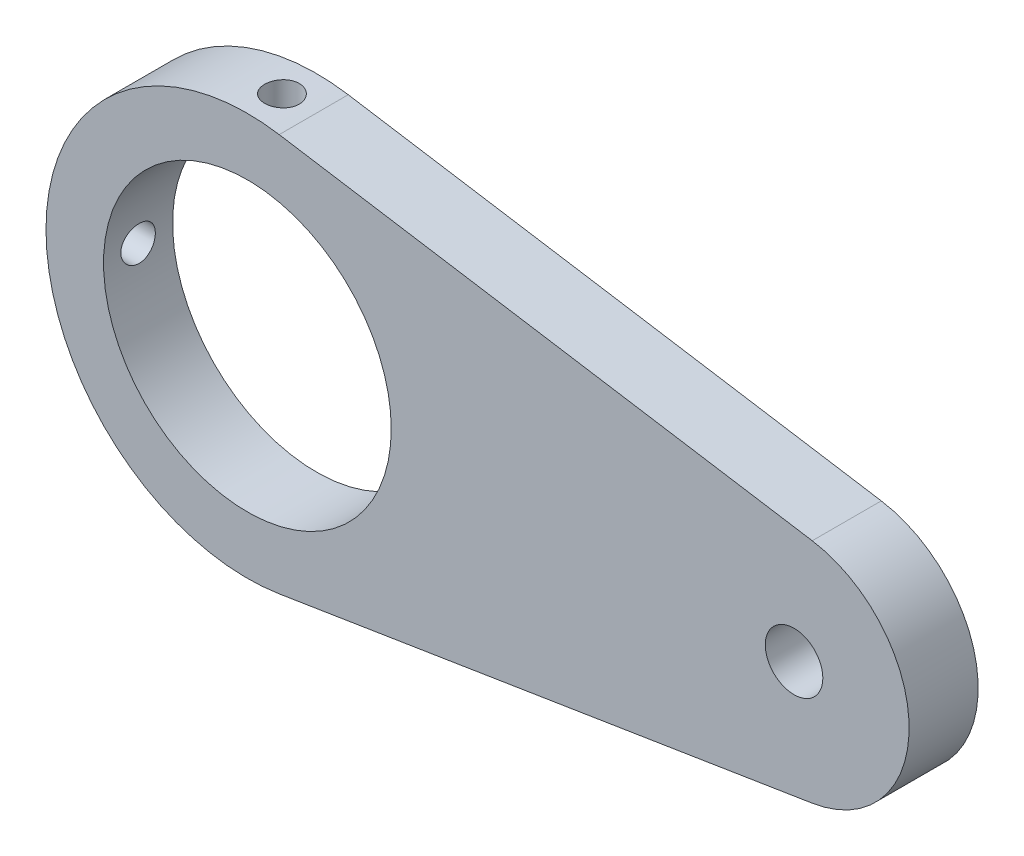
ISO-10303-21;
HEADER;
FILE_DESCRIPTION(('STEP AP214'),'2;1');
FILE_NAME('part.step','',(''),(''),'','','');
FILE_SCHEMA(('AUTOMOTIVE_DESIGN { 1 0 10303 214 1 1 1 1 }'));
ENDSEC;
DATA;
#1=APPLICATION_CONTEXT('core data for automotive mechanical design processes');
#2=APPLICATION_PROTOCOL_DEFINITION('international standard','automotive_design',2000,#1);
#3=PRODUCT_CONTEXT('',#1,'mechanical');
#4=PRODUCT('Part','Part','',(#3));
#5=PRODUCT_RELATED_PRODUCT_CATEGORY('part','',(#4));
#6=PRODUCT_DEFINITION_FORMATION('','',#4);
#7=PRODUCT_DEFINITION_CONTEXT('part definition',#1,'design');
#8=PRODUCT_DEFINITION('design','',#6,#7);
#9=PRODUCT_DEFINITION_SHAPE('','',#8);
#10=(LENGTH_UNIT() NAMED_UNIT(*) SI_UNIT(.MILLI.,.METRE.));
#11=(NAMED_UNIT(*) PLANE_ANGLE_UNIT() SI_UNIT($,.RADIAN.));
#12=(NAMED_UNIT(*) SI_UNIT($,.STERADIAN.) SOLID_ANGLE_UNIT());
#13=UNCERTAINTY_MEASURE_WITH_UNIT(LENGTH_MEASURE(1.E-05),#10,'distance_accuracy_value','');
#14=(GEOMETRIC_REPRESENTATION_CONTEXT(3) GLOBAL_UNCERTAINTY_ASSIGNED_CONTEXT((#13)) GLOBAL_UNIT_ASSIGNED_CONTEXT((#10,
#11,#12)) REPRESENTATION_CONTEXT('',''));
#15=CARTESIAN_POINT('',(0.,0.,0.));
#16=DIRECTION('',(0.,0.,1.));
#17=DIRECTION('',(1.,0.,0.));
#18=AXIS2_PLACEMENT_3D('',#15,#16,#17);
#19=CARTESIAN_POINT('',(0.,0.,12.));
#20=DIRECTION('',(0.,0.,-1.));
#21=DIRECTION('',(-1.,0.,0.));
#22=AXIS2_PLACEMENT_3D('',#19,#20,#21);
#23=CYLINDRICAL_SURFACE('',#22,35.);
#24=CARTESIAN_POINT('',(0.,35.,9.));
#25=CARTESIAN_POINT('',(-0.168180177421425,34.9999983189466,8.99999266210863));
#26=CARTESIAN_POINT('',(-0.336474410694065,34.9987748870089,8.98581013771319));
#27=CARTESIAN_POINT('',(-0.668405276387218,34.9940120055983,8.92944276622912));
#28=CARTESIAN_POINT('',(-0.832036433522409,34.9904699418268,8.8872263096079));
#29=CARTESIAN_POINT('',(-1.14978580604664,34.9814700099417,8.77602193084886));
#30=CARTESIAN_POINT('',(-1.30390939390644,34.9760132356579,8.70704929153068));
#31=CARTESIAN_POINT('',(-1.5983553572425,34.9637955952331,8.54431808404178));
#32=CARTESIAN_POINT('',(-1.7386806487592,34.95703500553,8.45056476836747));
#33=CARTESIAN_POINT('',(-2.00196024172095,34.9429478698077,8.2406617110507));
#34=CARTESIAN_POINT('',(-2.12487233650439,34.9356200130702,8.12445911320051));
#35=CARTESIAN_POINT('',(-2.34947428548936,34.9212352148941,7.87306791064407));
#36=CARTESIAN_POINT('',(-2.45116320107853,34.9141782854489,7.73787846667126));
#37=CARTESIAN_POINT('',(-2.63057608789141,34.901120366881,7.45209423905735));
#38=CARTESIAN_POINT('',(-2.7082627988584,34.895121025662,7.30147598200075));
#39=CARTESIAN_POINT('',(-2.83722803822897,34.8848727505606,6.98927310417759));
#40=CARTESIAN_POINT('',(-2.88850705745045,34.8806237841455,6.82768868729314));
#41=CARTESIAN_POINT('',(-2.96307845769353,34.8743684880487,6.49856435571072));
#42=CARTESIAN_POINT('',(-2.98643979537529,34.8723566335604,6.33104017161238));
#43=CARTESIAN_POINT('',(-3.00472573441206,34.8707859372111,5.99443731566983));
#44=CARTESIAN_POINT('',(-2.99965089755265,34.8712270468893,5.82535867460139));
#45=CARTESIAN_POINT('',(-2.96126551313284,34.874507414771,5.49091935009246));
#46=CARTESIAN_POINT('',(-2.9280299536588,34.8773403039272,5.32554998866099));
#47=CARTESIAN_POINT('',(-2.83438308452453,34.8850750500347,5.00274549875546));
#48=CARTESIAN_POINT('',(-2.77397149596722,34.8899769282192,4.84531045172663));
#49=CARTESIAN_POINT('',(-2.62760362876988,34.9013046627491,4.54260489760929));
#50=CARTESIAN_POINT('',(-2.54161375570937,34.9077325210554,4.39735071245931));
#51=CARTESIAN_POINT('',(-2.34655446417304,34.9213861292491,4.12330862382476));
#52=CARTESIAN_POINT('',(-2.23748455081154,34.9286118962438,3.99452107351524));
#53=CARTESIAN_POINT('',(-1.99894091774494,34.9430754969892,3.75663207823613));
#54=CARTESIAN_POINT('',(-1.86940237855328,34.9503132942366,3.64759561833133));
#55=CARTESIAN_POINT('',(-1.59382461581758,34.9639632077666,3.45280656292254));
#56=CARTESIAN_POINT('',(-1.44778538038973,34.9703753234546,3.36705398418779));
#57=CARTESIAN_POINT('',(-1.1433091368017,34.9816527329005,3.2212707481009));
#58=CARTESIAN_POINT('',(-0.984870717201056,34.9865178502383,3.16124302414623));
#59=CARTESIAN_POINT('',(-0.660113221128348,34.9941511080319,3.06865924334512));
#60=CARTESIAN_POINT('',(-0.493794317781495,34.9969192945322,3.03610258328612));
#61=CARTESIAN_POINT('',(-0.158560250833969,35.0000408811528,2.99946669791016));
#62=CARTESIAN_POINT('',(0.0103450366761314,35.0004018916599,2.99529772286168));
#63=CARTESIAN_POINT('',(0.34645210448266,34.9986887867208,3.01532035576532));
#64=CARTESIAN_POINT('',(0.513653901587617,34.9966146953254,3.03951168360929));
#65=CARTESIAN_POINT('',(0.841351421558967,34.9902695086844,3.11549382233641));
#66=CARTESIAN_POINT('',(1.00185687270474,34.9860017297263,3.16724297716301));
#67=CARTESIAN_POINT('',(1.31190702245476,34.9757485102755,3.29682922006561));
#68=CARTESIAN_POINT('',(1.46145153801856,34.9697630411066,3.37466674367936));
#69=CARTESIAN_POINT('',(1.7457428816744,34.9567262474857,3.55444535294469));
#70=CARTESIAN_POINT('',(1.88045202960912,34.9496723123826,3.65644583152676));
#71=CARTESIAN_POINT('',(2.13086824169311,34.9352996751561,3.88156921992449));
#72=CARTESIAN_POINT('',(2.24657495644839,34.9279809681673,4.00469251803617));
#73=CARTESIAN_POINT('',(2.45601016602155,34.9138810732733,4.26895626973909));
#74=CARTESIAN_POINT('',(2.54968004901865,34.9071013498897,4.41014326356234));
#75=CARTESIAN_POINT('',(2.71198063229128,34.8948680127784,4.70629524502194));
#76=CARTESIAN_POINT('',(2.78061159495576,34.8894143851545,4.8612600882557));
#77=CARTESIAN_POINT('',(2.8907865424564,34.8804590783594,5.18036221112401));
#78=CARTESIAN_POINT('',(2.93236627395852,34.8769548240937,5.34448707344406));
#79=CARTESIAN_POINT('',(2.98737479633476,34.872286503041,5.67742005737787));
#80=CARTESIAN_POINT('',(3.0008041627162,34.871122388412,5.84622808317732));
#81=CARTESIAN_POINT('',(2.99912392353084,34.8712668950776,6.18315306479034));
#82=CARTESIAN_POINT('',(2.98410640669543,34.8725675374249,6.35127049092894));
#83=CARTESIAN_POINT('',(2.92615085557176,34.8774780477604,6.68258592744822));
#84=CARTESIAN_POINT('',(2.88321277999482,34.8810879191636,6.84578393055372));
#85=CARTESIAN_POINT('',(2.7706585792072,34.8902080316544,7.16263302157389));
#86=CARTESIAN_POINT('',(2.70104425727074,34.8957181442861,7.3162847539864));
#87=CARTESIAN_POINT('',(2.53712384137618,34.9080181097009,7.60973557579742));
#88=CARTESIAN_POINT('',(2.4428181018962,34.9148079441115,7.74953486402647));
#89=CARTESIAN_POINT('',(2.23184571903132,34.9289284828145,8.01178384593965));
#90=CARTESIAN_POINT('',(2.11511080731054,34.9362607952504,8.13417853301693));
#91=CARTESIAN_POINT('',(1.86271960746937,34.9506254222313,8.357688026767));
#92=CARTESIAN_POINT('',(1.72705875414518,34.9576576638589,8.45879768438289));
#93=CARTESIAN_POINT('',(1.44039065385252,34.9706432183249,8.63701082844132));
#94=CARTESIAN_POINT('',(1.28935405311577,34.9765944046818,8.71406721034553));
#95=CARTESIAN_POINT('',(0.976537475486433,34.9867226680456,8.84162677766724));
#96=CARTESIAN_POINT('',(0.81477005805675,34.9909017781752,8.89216040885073));
#97=CARTESIAN_POINT('',(0.543377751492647,34.9959451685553,8.95240549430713));
#98=CARTESIAN_POINT('',(0.435496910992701,34.9974587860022,8.97022962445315));
#99=CARTESIAN_POINT('',(0.218426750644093,34.9994867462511,8.99402924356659));
#100=CARTESIAN_POINT('',(0.109237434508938,35.0000010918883,9.00000476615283));
#101=CARTESIAN_POINT('',(0.,35.,9.));
#102=B_SPLINE_CURVE_WITH_KNOTS('',3,(#24,#25,#26,#27,#28,#29,#30,#31,#32,#33,#34,#35,#36,#37,
#38,#39,#40,#41,#42,#43,#44,#45,#46,#47,#48,#49,#50,#51,#52,#53,#54,#55,#56,#57,#58,#59,#60,#61,
#62,#63,#64,#65,#66,#67,#68,#69,#70,#71,#72,#73,#74,#75,#76,#77,#78,#79,#80,#81,#82,#83,#84,#85,
#86,#87,#88,#89,#90,#91,#92,#93,#94,#95,#96,#97,#98,#99,#100,#101),.UNSPECIFIED.,.T.,.F.,(4,2,2,
2,2,2,2,2,2,2,2,2,2,2,2,2,2,2,2,2,2,2,2,2,2,2,2,2,2,2,2,2,2,2,2,2,2,2,4),(0.,0.504141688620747,
1.00885278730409,1.51327602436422,2.01759242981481,2.5231110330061,3.02865198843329,
3.53497383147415,4.04128626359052,4.54634550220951,5.05139476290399,5.55510335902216,
6.05881712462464,6.56319540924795,7.06758450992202,7.57360414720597,8.07962414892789,
8.58570183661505,9.09176841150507,9.59623427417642,10.1006951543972,10.6043956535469,
11.1081045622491,11.6130646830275,12.1180340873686,12.6243317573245,13.1306241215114,
13.636246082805,14.1418577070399,14.6458353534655,15.1498137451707,15.6537580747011,
16.1576951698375,16.6631911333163,17.1688092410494,17.6754113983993,18.1814307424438,
18.5088849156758,18.8363381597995),.UNSPECIFIED.);
#103=CARTESIAN_POINT('',(0.,35.,9.));
#104=VERTEX_POINT('',#103);
#105=EDGE_CURVE('E121',#104,#104,#102,.T.);
#106=ORIENTED_EDGE('',*,*,#105,.T.);
#107=EDGE_LOOP('',(#106));
#108=FACE_BOUND('',#107,.T.);
#109=CARTESIAN_POINT('',(0.,0.,0.));
#110=DIRECTION('',(0.,0.,1.));
#111=DIRECTION('',(1.,0.,0.));
#112=AXIS2_PLACEMENT_3D('',#109,#110,#111);
#113=CIRCLE('',#112,35.);
#114=CARTESIAN_POINT('',(5.52631578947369,34.5609582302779,0.));
#115=VERTEX_POINT('',#114);
#116=CARTESIAN_POINT('',(5.52631578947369,-34.5609582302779,0.));
#117=VERTEX_POINT('',#116);
#118=EDGE_CURVE('E108',#115,#117,#113,.T.);
#119=ORIENTED_EDGE('',*,*,#118,.T.);
#120=DIRECTION('',(0.,0.,-1.));
#121=VECTOR('',#120,1.);
#122=CARTESIAN_POINT('',(5.52631578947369,-34.5609582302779,12.));
#123=LINE('',#122,#121);
#124=CARTESIAN_POINT('',(5.52631578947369,-34.5609582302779,12.));
#125=VERTEX_POINT('',#124);
#126=EDGE_CURVE('E11',#125,#117,#123,.T.);
#127=ORIENTED_EDGE('',*,*,#126,.F.);
#128=CARTESIAN_POINT('',(0.,0.,12.));
#129=DIRECTION('',(0.,0.,1.));
#130=DIRECTION('',(1.,0.,0.));
#131=AXIS2_PLACEMENT_3D('',#128,#129,#130);
#132=CIRCLE('',#131,35.);
#133=CARTESIAN_POINT('',(5.52631578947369,34.5609582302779,12.));
#134=VERTEX_POINT('',#133);
#135=EDGE_CURVE('E95',#134,#125,#132,.T.);
#136=ORIENTED_EDGE('',*,*,#135,.F.);
#137=DIRECTION('',(0.,0.,-1.));
#138=VECTOR('',#137,1.);
#139=CARTESIAN_POINT('',(5.52631578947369,34.5609582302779,12.));
#140=LINE('',#139,#138);
#141=EDGE_CURVE('E104',#134,#115,#140,.T.);
#142=ORIENTED_EDGE('',*,*,#141,.T.);
#143=EDGE_LOOP('',(#119,#127,#136,#142));
#144=FACE_BOUND('',#143,.T.);
#145=CARTESIAN_POINT('',(-35.,0.,9.));
#146=CARTESIAN_POINT('',(-34.9999983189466,0.168180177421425,8.99999266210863));
#147=CARTESIAN_POINT('',(-34.9987748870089,0.336474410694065,8.98581013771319));
#148=CARTESIAN_POINT('',(-34.9940120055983,0.668405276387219,8.92944276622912));
#149=CARTESIAN_POINT('',(-34.9904699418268,0.83203643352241,8.8872263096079));
#150=CARTESIAN_POINT('',(-34.9814700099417,1.14978580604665,8.77602193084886));
#151=CARTESIAN_POINT('',(-34.9760132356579,1.30390939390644,8.70704929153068));
#152=CARTESIAN_POINT('',(-34.9637955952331,1.5983553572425,8.54431808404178));
#153=CARTESIAN_POINT('',(-34.95703500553,1.7386806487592,8.45056476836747));
#154=CARTESIAN_POINT('',(-34.9429478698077,2.00196024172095,8.2406617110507));
#155=CARTESIAN_POINT('',(-34.9356200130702,2.12487233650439,8.12445911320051));
#156=CARTESIAN_POINT('',(-34.9212352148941,2.34947428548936,7.87306791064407));
#157=CARTESIAN_POINT('',(-34.9141782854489,2.45116320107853,7.73787846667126));
#158=CARTESIAN_POINT('',(-34.901120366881,2.63057608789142,7.45209423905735));
#159=CARTESIAN_POINT('',(-34.895121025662,2.70826279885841,7.30147598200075));
#160=CARTESIAN_POINT('',(-34.8848727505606,2.83722803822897,6.98927310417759));
#161=CARTESIAN_POINT('',(-34.8806237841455,2.88850705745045,6.82768868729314));
#162=CARTESIAN_POINT('',(-34.8743684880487,2.96307845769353,6.49856435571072));
#163=CARTESIAN_POINT('',(-34.8723566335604,2.98643979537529,6.33104017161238));
#164=CARTESIAN_POINT('',(-34.8707859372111,3.00472573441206,5.99443731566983));
#165=CARTESIAN_POINT('',(-34.8712270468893,2.99965089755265,5.82535867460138));
#166=CARTESIAN_POINT('',(-34.874507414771,2.96126551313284,5.49091935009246));
#167=CARTESIAN_POINT('',(-34.8773403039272,2.92802995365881,5.32554998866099));
#168=CARTESIAN_POINT('',(-34.8850750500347,2.83438308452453,5.00274549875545));
#169=CARTESIAN_POINT('',(-34.8899769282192,2.77397149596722,4.84531045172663));
#170=CARTESIAN_POINT('',(-34.9013046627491,2.62760362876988,4.54260489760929));
#171=CARTESIAN_POINT('',(-34.9077325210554,2.54161375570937,4.39735071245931));
#172=CARTESIAN_POINT('',(-34.9213861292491,2.34655446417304,4.12330862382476));
#173=CARTESIAN_POINT('',(-34.9286118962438,2.23748455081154,3.99452107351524));
#174=CARTESIAN_POINT('',(-34.9430754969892,1.99894091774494,3.75663207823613));
#175=CARTESIAN_POINT('',(-34.9503132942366,1.86940237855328,3.64759561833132));
#176=CARTESIAN_POINT('',(-34.9639632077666,1.59382461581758,3.45280656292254));
#177=CARTESIAN_POINT('',(-34.9703753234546,1.44778538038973,3.36705398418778));
#178=CARTESIAN_POINT('',(-34.9816527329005,1.1433091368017,3.2212707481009));
#179=CARTESIAN_POINT('',(-34.9865178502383,0.984870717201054,3.16124302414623));
#180=CARTESIAN_POINT('',(-34.9941511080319,0.660113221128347,3.06865924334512));
#181=CARTESIAN_POINT('',(-34.9969192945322,0.493794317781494,3.03610258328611));
#182=CARTESIAN_POINT('',(-35.0000408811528,0.158560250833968,2.99946669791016));
#183=CARTESIAN_POINT('',(-35.0004018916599,-0.0103450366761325,2.99529772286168));
#184=CARTESIAN_POINT('',(-34.9986887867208,-0.346452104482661,3.01532035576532));
#185=CARTESIAN_POINT('',(-34.9966146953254,-0.513653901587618,3.03951168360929));
#186=CARTESIAN_POINT('',(-34.9902695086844,-0.841351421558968,3.11549382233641));
#187=CARTESIAN_POINT('',(-34.9860017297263,-1.00185687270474,3.16724297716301));
#188=CARTESIAN_POINT('',(-34.9757485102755,-1.31190702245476,3.29682922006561));
#189=CARTESIAN_POINT('',(-34.9697630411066,-1.46145153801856,3.37466674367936));
#190=CARTESIAN_POINT('',(-34.9567262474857,-1.7457428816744,3.55444535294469));
#191=CARTESIAN_POINT('',(-34.9496723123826,-1.88045202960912,3.65644583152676));
#192=CARTESIAN_POINT('',(-34.9352996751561,-2.13086824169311,3.88156921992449));
#193=CARTESIAN_POINT('',(-34.9279809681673,-2.2465749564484,4.00469251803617));
#194=CARTESIAN_POINT('',(-34.9138810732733,-2.45601016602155,4.26895626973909));
#195=CARTESIAN_POINT('',(-34.9071013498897,-2.54968004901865,4.41014326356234));
#196=CARTESIAN_POINT('',(-34.8948680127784,-2.71198063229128,4.70629524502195));
#197=CARTESIAN_POINT('',(-34.8894143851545,-2.78061159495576,4.8612600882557));
#198=CARTESIAN_POINT('',(-34.8804590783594,-2.8907865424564,5.18036221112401));
#199=CARTESIAN_POINT('',(-34.8769548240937,-2.93236627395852,5.34448707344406));
#200=CARTESIAN_POINT('',(-34.872286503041,-2.98737479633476,5.67742005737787));
#201=CARTESIAN_POINT('',(-34.871122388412,-3.00080416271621,5.84622808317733));
#202=CARTESIAN_POINT('',(-34.8712668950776,-2.99912392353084,6.18315306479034));
#203=CARTESIAN_POINT('',(-34.8725675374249,-2.98410640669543,6.35127049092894));
#204=CARTESIAN_POINT('',(-34.8774780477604,-2.92615085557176,6.68258592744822));
#205=CARTESIAN_POINT('',(-34.8810879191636,-2.88321277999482,6.84578393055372));
#206=CARTESIAN_POINT('',(-34.8902080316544,-2.7706585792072,7.16263302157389));
#207=CARTESIAN_POINT('',(-34.8957181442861,-2.70104425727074,7.3162847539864));
#208=CARTESIAN_POINT('',(-34.9080181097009,-2.53712384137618,7.60973557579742));
#209=CARTESIAN_POINT('',(-34.9148079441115,-2.4428181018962,7.74953486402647));
#210=CARTESIAN_POINT('',(-34.9289284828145,-2.23184571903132,8.01178384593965));
#211=CARTESIAN_POINT('',(-34.9362607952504,-2.11511080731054,8.13417853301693));
#212=CARTESIAN_POINT('',(-34.9506254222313,-1.86271960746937,8.357688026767));
#213=CARTESIAN_POINT('',(-34.9576576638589,-1.72705875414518,8.4587976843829));
#214=CARTESIAN_POINT('',(-34.9706432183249,-1.44039065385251,8.63701082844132));
#215=CARTESIAN_POINT('',(-34.9765944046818,-1.28935405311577,8.71406721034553));
#216=CARTESIAN_POINT('',(-34.9867226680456,-0.976537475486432,8.84162677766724));
#217=CARTESIAN_POINT('',(-34.9909017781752,-0.814770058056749,8.89216040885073));
#218=CARTESIAN_POINT('',(-34.9959451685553,-0.543377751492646,8.95240549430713));
#219=CARTESIAN_POINT('',(-34.9974587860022,-0.435496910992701,8.97022962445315));
#220=CARTESIAN_POINT('',(-34.9994867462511,-0.218426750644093,8.99402924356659));
#221=CARTESIAN_POINT('',(-35.0000010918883,-0.109237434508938,9.00000476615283));
#222=CARTESIAN_POINT('',(-35.,0.,9.));
#223=B_SPLINE_CURVE_WITH_KNOTS('',3,(#145,#146,#147,#148,#149,#150,#151,#152,#153,#154,#155,
#156,#157,#158,#159,#160,#161,#162,#163,#164,#165,#166,#167,#168,#169,#170,#171,#172,#173,#174,
#175,#176,#177,#178,#179,#180,#181,#182,#183,#184,#185,#186,#187,#188,#189,#190,#191,#192,#193,
#194,#195,#196,#197,#198,#199,#200,#201,#202,#203,#204,#205,#206,#207,#208,#209,#210,#211,#212,
#213,#214,#215,#216,#217,#218,#219,#220,#221,#222),.UNSPECIFIED.,.T.,.F.,(4,2,2,2,2,2,2,2,2,2,2,
2,2,2,2,2,2,2,2,2,2,2,2,2,2,2,2,2,2,2,2,2,2,2,2,2,2,2,4),(0.,0.504141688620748,1.0088527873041,
1.51327602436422,2.01759242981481,2.5231110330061,3.0286519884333,3.53497383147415,
4.04128626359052,4.54634550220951,5.05139476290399,5.55510335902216,6.05881712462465,
6.56319540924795,7.06758450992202,7.57360414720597,8.07962414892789,8.58570183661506,
9.09176841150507,9.59623427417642,10.1006951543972,10.6043956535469,11.1081045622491,
11.6130646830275,12.1180340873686,12.6243317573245,13.1306241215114,13.636246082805,
14.1418577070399,14.6458353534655,15.1498137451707,15.6537580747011,16.1576951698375,
16.6631911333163,17.1688092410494,17.6754113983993,18.1814307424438,18.5088849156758,
18.8363381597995),.UNSPECIFIED.);
#224=CARTESIAN_POINT('',(-35.,0.,9.));
#225=VERTEX_POINT('',#224);
#226=EDGE_CURVE('E122',#225,#225,#223,.T.);
#227=ORIENTED_EDGE('',*,*,#226,.F.);
#228=EDGE_LOOP('',(#227));
#229=FACE_BOUND('',#228,.T.);
#230=ADVANCED_FACE('F36',(#108,#144,#229),#23,.T.);
#231=CARTESIAN_POINT('',(0.,0.,12.));
#232=DIRECTION('',(0.,0.,-1.));
#233=DIRECTION('',(-1.,0.,0.));
#234=AXIS2_PLACEMENT_3D('',#231,#232,#233);
#235=CYLINDRICAL_SURFACE('',#234,25.);
#236=CARTESIAN_POINT('',(0.,0.,0.));
#237=DIRECTION('',(0.,0.,1.));
#238=DIRECTION('',(1.,0.,0.));
#239=AXIS2_PLACEMENT_3D('',#236,#237,#238);
#240=CIRCLE('',#239,25.);
#241=CARTESIAN_POINT('',(25.,0.,0.));
#242=VERTEX_POINT('',#241);
#243=EDGE_CURVE('E147',#242,#242,#240,.T.);
#244=ORIENTED_EDGE('',*,*,#243,.F.);
#245=EDGE_LOOP('',(#244));
#246=FACE_BOUND('',#245,.T.);
#247=CARTESIAN_POINT('',(0.,0.,12.));
#248=DIRECTION('',(0.,0.,1.));
#249=DIRECTION('',(1.,0.,0.));
#250=AXIS2_PLACEMENT_3D('',#247,#248,#249);
#251=CIRCLE('',#250,25.);
#252=CARTESIAN_POINT('',(25.,0.,12.));
#253=VERTEX_POINT('',#252);
#254=EDGE_CURVE('E111',#253,#253,#251,.T.);
#255=ORIENTED_EDGE('',*,*,#254,.T.);
#256=EDGE_LOOP('',(#255));
#257=FACE_BOUND('',#256,.T.);
#258=CARTESIAN_POINT('',(0.,25.,9.));
#259=CARTESIAN_POINT('',(-0.167864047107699,24.9999977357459,8.99999283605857));
#260=CARTESIAN_POINT('',(-0.33583431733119,24.9982914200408,8.98586334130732));
#261=CARTESIAN_POINT('',(-0.667104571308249,24.991648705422,8.92971893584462));
#262=CARTESIAN_POINT('',(-0.830399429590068,24.9867088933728,8.88767455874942));
#263=CARTESIAN_POINT('',(-1.14747479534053,24.9741559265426,8.77695372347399));
#264=CARTESIAN_POINT('',(-1.30126148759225,24.9665445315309,8.70829479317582));
#265=CARTESIAN_POINT('',(-1.595099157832,24.9494959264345,8.5463312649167));
#266=CARTESIAN_POINT('',(-1.73515256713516,24.9400590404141,8.45303104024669));
#267=CARTESIAN_POINT('',(-1.99829131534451,24.920360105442,8.24392513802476));
#268=CARTESIAN_POINT('',(-2.1212966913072,24.9100945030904,8.12801915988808));
#269=CARTESIAN_POINT('',(-2.34615931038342,24.8899239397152,7.8772070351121));
#270=CARTESIAN_POINT('',(-2.44801549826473,24.8800189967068,7.74229994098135));
#271=CARTESIAN_POINT('',(-2.62798342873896,24.8616560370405,7.45679917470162));
#272=CARTESIAN_POINT('',(-2.7060207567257,24.8532025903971,7.30615827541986));
#273=CARTESIAN_POINT('',(-2.8356605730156,24.8387461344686,6.99379129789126));
#274=CARTESIAN_POINT('',(-2.88726398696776,24.8327430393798,6.8320656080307));
#275=CARTESIAN_POINT('',(-2.96232930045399,24.8239006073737,6.50294714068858));
#276=CARTESIAN_POINT('',(-2.98592577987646,24.8210461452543,6.33558547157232));
#277=CARTESIAN_POINT('',(-3.0047237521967,24.8187777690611,5.99925506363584));
#278=CARTESIAN_POINT('',(-2.99992630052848,24.8193637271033,5.83028638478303));
#279=CARTESIAN_POINT('',(-2.96218316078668,24.8238961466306,5.49647403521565));
#280=CARTESIAN_POINT('',(-2.92938543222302,24.8278249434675,5.33161336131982));
#281=CARTESIAN_POINT('',(-2.83680346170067,24.8385728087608,5.00975297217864));
#282=CARTESIAN_POINT('',(-2.77701871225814,24.8453919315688,4.852753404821));
#283=CARTESIAN_POINT('',(-2.63199980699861,24.8611722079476,4.55061053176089));
#284=CARTESIAN_POINT('',(-2.54670106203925,24.8701387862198,4.40549852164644));
#285=CARTESIAN_POINT('',(-2.35312173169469,24.8891993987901,4.13159278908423));
#286=CARTESIAN_POINT('',(-2.24484017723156,24.8992934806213,4.00279975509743));
#287=CARTESIAN_POINT('',(-2.0075475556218,24.9195503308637,3.76432891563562));
#288=CARTESIAN_POINT('',(-1.87840890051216,24.929713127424,3.65477803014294));
#289=CARTESIAN_POINT('',(-1.60350795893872,24.9489020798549,3.45888847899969));
#290=CARTESIAN_POINT('',(-1.45774563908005,24.9579282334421,3.37254985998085));
#291=CARTESIAN_POINT('',(-1.15363930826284,24.9738318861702,3.22553671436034));
#292=CARTESIAN_POINT('',(-0.995291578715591,24.9807087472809,3.16486980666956));
#293=CARTESIAN_POINT('',(-0.670556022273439,24.991533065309,3.0710212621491));
#294=CARTESIAN_POINT('',(-0.504168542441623,24.9954806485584,3.03783843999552));
#295=CARTESIAN_POINT('',(-0.169174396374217,24.9999852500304,3.00006374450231));
#296=CARTESIAN_POINT('',(-0.000587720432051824,25.0005630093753,2.9952969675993));
#297=CARTESIAN_POINT('',(0.33498206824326,24.9983187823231,3.01402857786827));
#298=CARTESIAN_POINT('',(0.501965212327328,24.9954968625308,3.03752641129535));
#299=CARTESIAN_POINT('',(0.829074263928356,24.9867833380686,3.11197496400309));
#300=CARTESIAN_POINT('',(0.989219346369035,24.9809010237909,3.16284261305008));
#301=CARTESIAN_POINT('',(1.29870539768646,24.9667255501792,3.29050070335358));
#302=CARTESIAN_POINT('',(1.44804602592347,24.9584323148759,3.36729196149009));
#303=CARTESIAN_POINT('',(1.73246717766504,24.9403085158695,3.54504291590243));
#304=CARTESIAN_POINT('',(1.86747628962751,24.9304708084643,3.64611613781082));
#305=CARTESIAN_POINT('',(2.11867625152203,24.9103817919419,3.86940084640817));
#306=CARTESIAN_POINT('',(2.23486641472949,24.9001304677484,3.99161310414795));
#307=CARTESIAN_POINT('',(2.44574795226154,24.8803059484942,4.25447561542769));
#308=CARTESIAN_POINT('',(2.54032363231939,24.8707365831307,4.39521901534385));
#309=CARTESIAN_POINT('',(2.70449314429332,24.8534214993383,4.69069502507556));
#310=CARTESIAN_POINT('',(2.77408744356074,24.8456757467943,4.84542737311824));
#311=CARTESIAN_POINT('',(2.88612996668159,24.8329105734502,5.16411060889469));
#312=CARTESIAN_POINT('',(2.92864420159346,24.8278845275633,5.32803801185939));
#313=CARTESIAN_POINT('',(2.98553272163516,24.8211085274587,5.66076896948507));
#314=CARTESIAN_POINT('',(2.99990820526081,24.8193584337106,5.82957231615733));
#315=CARTESIAN_POINT('',(3.00009033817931,24.819336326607,6.16611272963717));
#316=CARTESIAN_POINT('',(2.98607873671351,24.8210421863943,6.33384972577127));
#317=CARTESIAN_POINT('',(2.93026848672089,24.8276922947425,6.66456678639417));
#318=CARTESIAN_POINT('',(2.88846982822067,24.8326365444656,6.82754684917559));
#319=CARTESIAN_POINT('',(2.77832739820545,24.8451996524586,7.1441045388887));
#320=CARTESIAN_POINT('',(2.70999165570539,24.8528177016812,7.29768499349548));
#321=CARTESIAN_POINT('',(2.5487328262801,24.8698714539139,7.5912277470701));
#322=CARTESIAN_POINT('',(2.45580952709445,24.8793071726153,7.73118992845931));
#323=CARTESIAN_POINT('',(2.24733689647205,24.8990055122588,7.99445294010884));
#324=CARTESIAN_POINT('',(2.1316520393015,24.9092728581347,8.11764610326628));
#325=CARTESIAN_POINT('',(1.88122093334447,24.9294354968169,8.342942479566));
#326=CARTESIAN_POINT('',(1.74647018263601,24.939330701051,8.44504069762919));
#327=CARTESIAN_POINT('',(1.46119322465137,24.9576721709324,8.62555057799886));
#328=CARTESIAN_POINT('',(1.31061323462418,24.966113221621,8.70387772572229));
#329=CARTESIAN_POINT('',(0.998422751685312,24.9805418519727,8.83402376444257));
#330=CARTESIAN_POINT('',(0.836824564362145,24.9865321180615,8.88587169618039));
#331=CARTESIAN_POINT('',(0.561977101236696,24.9939268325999,8.94906342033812));
#332=CARTESIAN_POINT('',(0.450466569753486,24.996193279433,8.96813748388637));
#333=CARTESIAN_POINT('',(0.225986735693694,24.9992306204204,8.99360814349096));
#334=CARTESIAN_POINT('',(0.113017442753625,25.0000015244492,9.00000482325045));
#335=CARTESIAN_POINT('',(0.,25.,9.));
#336=B_SPLINE_CURVE_WITH_KNOTS('',3,(#258,#259,#260,#261,#262,#263,#264,#265,#266,#267,#268,
#269,#270,#271,#272,#273,#274,#275,#276,#277,#278,#279,#280,#281,#282,#283,#284,#285,#286,#287,
#288,#289,#290,#291,#292,#293,#294,#295,#296,#297,#298,#299,#300,#301,#302,#303,#304,#305,#306,
#307,#308,#309,#310,#311,#312,#313,#314,#315,#316,#317,#318,#319,#320,#321,#322,#323,#324,#325,
#326,#327,#328,#329,#330,#331,#332,#333,#334,#335),.UNSPECIFIED.,.T.,.F.,(4,2,2,2,2,2,2,2,2,2,2,
2,2,2,2,2,2,2,2,2,2,2,2,2,2,2,2,2,2,2,2,2,2,2,2,2,2,2,4),(0.,0.503179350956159,1.00689069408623,
1.5102708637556,2.01356175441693,2.51913872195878,3.02474090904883,3.53190689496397,
4.03905511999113,4.54375638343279,5.0484388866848,5.55047092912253,6.05251241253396,
6.55583573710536,7.05918028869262,7.56572944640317,8.07227962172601,8.57898002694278,
9.08565857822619,9.58921522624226,10.0927620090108,10.5947890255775,11.0968318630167,
11.6012692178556,12.1057249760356,12.6128207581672,13.119907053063,13.6257524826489,
14.1315763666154,14.6341719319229,15.1367676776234,15.6392114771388,16.1416596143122,
16.6471952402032,17.1528504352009,17.6602829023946,18.1671576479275,18.5059342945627,
18.8447087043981),.UNSPECIFIED.);
#337=CARTESIAN_POINT('',(0.,25.,9.));
#338=VERTEX_POINT('',#337);
#339=EDGE_CURVE('E116',#338,#338,#336,.T.);
#340=ORIENTED_EDGE('',*,*,#339,.F.);
#341=EDGE_LOOP('',(#340));
#342=FACE_BOUND('',#341,.T.);
#343=CARTESIAN_POINT('',(-25.,0.,9.));
#344=CARTESIAN_POINT('',(-24.9999977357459,0.167864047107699,8.99999283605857));
#345=CARTESIAN_POINT('',(-24.9982914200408,0.335834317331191,8.98586334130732));
#346=CARTESIAN_POINT('',(-24.991648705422,0.66710457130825,8.92971893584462));
#347=CARTESIAN_POINT('',(-24.9867088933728,0.830399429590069,8.88767455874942));
#348=CARTESIAN_POINT('',(-24.9741559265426,1.14747479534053,8.77695372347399));
#349=CARTESIAN_POINT('',(-24.9665445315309,1.30126148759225,8.70829479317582));
#350=CARTESIAN_POINT('',(-24.9494959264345,1.595099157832,8.5463312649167));
#351=CARTESIAN_POINT('',(-24.9400590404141,1.73515256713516,8.45303104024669));
#352=CARTESIAN_POINT('',(-24.920360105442,1.99829131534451,8.24392513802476));
#353=CARTESIAN_POINT('',(-24.9100945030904,2.1212966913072,8.12801915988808));
#354=CARTESIAN_POINT('',(-24.8899239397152,2.34615931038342,7.8772070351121));
#355=CARTESIAN_POINT('',(-24.8800189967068,2.44801549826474,7.74229994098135));
#356=CARTESIAN_POINT('',(-24.8616560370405,2.62798342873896,7.45679917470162));
#357=CARTESIAN_POINT('',(-24.8532025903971,2.7060207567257,7.30615827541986));
#358=CARTESIAN_POINT('',(-24.8387461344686,2.8356605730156,6.99379129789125));
#359=CARTESIAN_POINT('',(-24.8327430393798,2.88726398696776,6.8320656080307));
#360=CARTESIAN_POINT('',(-24.8239006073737,2.96232930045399,6.50294714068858));
#361=CARTESIAN_POINT('',(-24.8210461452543,2.98592577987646,6.33558547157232));
#362=CARTESIAN_POINT('',(-24.8187777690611,3.0047237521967,5.99925506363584));
#363=CARTESIAN_POINT('',(-24.8193637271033,2.99992630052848,5.83028638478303));
#364=CARTESIAN_POINT('',(-24.8238961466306,2.96218316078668,5.49647403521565));
#365=CARTESIAN_POINT('',(-24.8278249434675,2.92938543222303,5.33161336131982));
#366=CARTESIAN_POINT('',(-24.8385728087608,2.83680346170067,5.00975297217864));
#367=CARTESIAN_POINT('',(-24.8453919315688,2.77701871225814,4.852753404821));
#368=CARTESIAN_POINT('',(-24.8611722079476,2.63199980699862,4.55061053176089));
#369=CARTESIAN_POINT('',(-24.8701387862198,2.54670106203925,4.40549852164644));
#370=CARTESIAN_POINT('',(-24.8891993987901,2.35312173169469,4.13159278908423));
#371=CARTESIAN_POINT('',(-24.8992934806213,2.24484017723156,4.00279975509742));
#372=CARTESIAN_POINT('',(-24.9195503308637,2.0075475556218,3.76432891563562));
#373=CARTESIAN_POINT('',(-24.929713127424,1.87840890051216,3.65477803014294));
#374=CARTESIAN_POINT('',(-24.9489020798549,1.60350795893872,3.45888847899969));
#375=CARTESIAN_POINT('',(-24.9579282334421,1.45774563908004,3.37254985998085));
#376=CARTESIAN_POINT('',(-24.9738318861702,1.15363930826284,3.22553671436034));
#377=CARTESIAN_POINT('',(-24.9807087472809,0.99529157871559,3.16486980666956));
#378=CARTESIAN_POINT('',(-24.991533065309,0.670556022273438,3.0710212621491));
#379=CARTESIAN_POINT('',(-24.9954806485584,0.504168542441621,3.03783843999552));
#380=CARTESIAN_POINT('',(-24.9999852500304,0.169174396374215,3.00006374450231));
#381=CARTESIAN_POINT('',(-25.0005630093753,0.000587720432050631,2.9952969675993));
#382=CARTESIAN_POINT('',(-24.9983187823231,-0.334982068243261,3.01402857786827));
#383=CARTESIAN_POINT('',(-24.9954968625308,-0.50196521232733,3.03752641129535));
#384=CARTESIAN_POINT('',(-24.9867833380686,-0.829074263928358,3.11197496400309));
#385=CARTESIAN_POINT('',(-24.9809010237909,-0.989219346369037,3.16284261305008));
#386=CARTESIAN_POINT('',(-24.9667255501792,-1.29870539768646,3.29050070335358));
#387=CARTESIAN_POINT('',(-24.9584323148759,-1.44804602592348,3.36729196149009));
#388=CARTESIAN_POINT('',(-24.9403085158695,-1.73246717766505,3.54504291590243));
#389=CARTESIAN_POINT('',(-24.9304708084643,-1.86747628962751,3.64611613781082));
#390=CARTESIAN_POINT('',(-24.9103817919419,-2.11867625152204,3.86940084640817));
#391=CARTESIAN_POINT('',(-24.9001304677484,-2.23486641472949,3.99161310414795));
#392=CARTESIAN_POINT('',(-24.8803059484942,-2.44574795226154,4.25447561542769));
#393=CARTESIAN_POINT('',(-24.8707365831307,-2.54032363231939,4.39521901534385));
#394=CARTESIAN_POINT('',(-24.8534214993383,-2.70449314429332,4.69069502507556));
#395=CARTESIAN_POINT('',(-24.8456757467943,-2.77408744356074,4.84542737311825));
#396=CARTESIAN_POINT('',(-24.8329105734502,-2.88612996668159,5.1641106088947));
#397=CARTESIAN_POINT('',(-24.8278845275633,-2.92864420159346,5.32803801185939));
#398=CARTESIAN_POINT('',(-24.8211085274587,-2.98553272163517,5.66076896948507));
#399=CARTESIAN_POINT('',(-24.8193584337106,-2.99990820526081,5.82957231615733));
#400=CARTESIAN_POINT('',(-24.819336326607,-3.00009033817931,6.16611272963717));
#401=CARTESIAN_POINT('',(-24.8210421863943,-2.98607873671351,6.33384972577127));
#402=CARTESIAN_POINT('',(-24.8276922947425,-2.93026848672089,6.66456678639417));
#403=CARTESIAN_POINT('',(-24.8326365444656,-2.88846982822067,6.82754684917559));
#404=CARTESIAN_POINT('',(-24.8451996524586,-2.77832739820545,7.1441045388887));
#405=CARTESIAN_POINT('',(-24.8528177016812,-2.70999165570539,7.29768499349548));
#406=CARTESIAN_POINT('',(-24.8698714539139,-2.5487328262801,7.5912277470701));
#407=CARTESIAN_POINT('',(-24.8793071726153,-2.45580952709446,7.73118992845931));
#408=CARTESIAN_POINT('',(-24.8990055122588,-2.24733689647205,7.99445294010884));
#409=CARTESIAN_POINT('',(-24.9092728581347,-2.1316520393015,8.11764610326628));
#410=CARTESIAN_POINT('',(-24.9294354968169,-1.88122093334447,8.342942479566));
#411=CARTESIAN_POINT('',(-24.939330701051,-1.74647018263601,8.44504069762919));
#412=CARTESIAN_POINT('',(-24.9576721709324,-1.46119322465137,8.62555057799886));
#413=CARTESIAN_POINT('',(-24.966113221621,-1.31061323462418,8.70387772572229));
#414=CARTESIAN_POINT('',(-24.9805418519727,-0.998422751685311,8.83402376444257));
#415=CARTESIAN_POINT('',(-24.9865321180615,-0.836824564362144,8.88587169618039));
#416=CARTESIAN_POINT('',(-24.9939268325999,-0.561977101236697,8.94906342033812));
#417=CARTESIAN_POINT('',(-24.996193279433,-0.450466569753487,8.96813748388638));
#418=CARTESIAN_POINT('',(-24.9992306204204,-0.225986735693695,8.99360814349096));
#419=CARTESIAN_POINT('',(-25.0000015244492,-0.113017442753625,9.00000482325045));
#420=CARTESIAN_POINT('',(-25.,0.,9.));
#421=B_SPLINE_CURVE_WITH_KNOTS('',3,(#343,#344,#345,#346,#347,#348,#349,#350,#351,#352,#353,
#354,#355,#356,#357,#358,#359,#360,#361,#362,#363,#364,#365,#366,#367,#368,#369,#370,#371,#372,
#373,#374,#375,#376,#377,#378,#379,#380,#381,#382,#383,#384,#385,#386,#387,#388,#389,#390,#391,
#392,#393,#394,#395,#396,#397,#398,#399,#400,#401,#402,#403,#404,#405,#406,#407,#408,#409,#410,
#411,#412,#413,#414,#415,#416,#417,#418,#419,#420),.UNSPECIFIED.,.T.,.F.,(4,2,2,2,2,2,2,2,2,2,2,
2,2,2,2,2,2,2,2,2,2,2,2,2,2,2,2,2,2,2,2,2,2,2,2,2,2,2,4),(0.,0.50317935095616,1.00689069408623,
1.5102708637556,2.01356175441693,2.51913872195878,3.02474090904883,3.53190689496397,
4.03905511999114,4.54375638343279,5.0484388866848,5.55047092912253,6.05251241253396,
6.55583573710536,7.05918028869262,7.56572944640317,8.07227962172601,8.57898002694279,
9.08565857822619,9.58921522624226,10.0927620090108,10.5947890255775,11.0968318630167,
11.6012692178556,12.1057249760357,12.6128207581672,13.119907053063,13.6257524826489,
14.1315763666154,14.6341719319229,15.1367676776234,15.6392114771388,16.1416596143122,
16.6471952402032,17.1528504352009,17.6602829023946,18.1671576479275,18.5059342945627,
18.8447087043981),.UNSPECIFIED.);
#422=CARTESIAN_POINT('',(-25.,0.,9.));
#423=VERTEX_POINT('',#422);
#424=EDGE_CURVE('E40',#423,#423,#421,.T.);
#425=ORIENTED_EDGE('',*,*,#424,.T.);
#426=EDGE_LOOP('',(#425));
#427=FACE_BOUND('',#426,.T.);
#428=ADVANCED_FACE('F123',(#246,#257,#342,#427),#235,.F.);
#429=CARTESIAN_POINT('',(0.,0.,12.));
#430=DIRECTION('',(0.,0.,1.));
#431=DIRECTION('',(1.,0.,0.));
#432=AXIS2_PLACEMENT_3D('',#429,#430,#431);
#433=PLANE('',#432);
#434=ORIENTED_EDGE('',*,*,#254,.F.);
#435=EDGE_LOOP('',(#434));
#436=FACE_BOUND('',#435,.T.);
#437=ORIENTED_EDGE('',*,*,#135,.T.);
#438=DIRECTION('',(0.987455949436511,0.157894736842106,0.));
#439=VECTOR('',#438,1.);
#440=CARTESIAN_POINT('',(5.52631578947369,-34.5609582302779,12.));
#441=LINE('',#440,#439);
#442=CARTESIAN_POINT('',(98.1578947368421,-19.7491189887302,12.));
#443=VERTEX_POINT('',#442);
#444=EDGE_CURVE('E89',#125,#443,#441,.T.);
#445=ORIENTED_EDGE('',*,*,#444,.T.);
#446=CARTESIAN_POINT('',(95.,0.,12.));
#447=DIRECTION('',(0.,0.,1.));
#448=DIRECTION('',(1.,0.,0.));
#449=AXIS2_PLACEMENT_3D('',#446,#447,#448);
#450=CIRCLE('',#449,20.);
#451=CARTESIAN_POINT('',(98.1578947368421,19.7491189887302,12.));
#452=VERTEX_POINT('',#451);
#453=EDGE_CURVE('E93',#443,#452,#450,.T.);
#454=ORIENTED_EDGE('',*,*,#453,.T.);
#455=DIRECTION('',(-0.987455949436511,0.157894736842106,0.));
#456=VECTOR('',#455,1.);
#457=CARTESIAN_POINT('',(5.52631578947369,34.5609582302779,12.));
#458=LINE('',#457,#456);
#459=EDGE_CURVE('E59',#452,#134,#458,.T.);
#460=ORIENTED_EDGE('',*,*,#459,.T.);
#461=EDGE_LOOP('',(#437,#445,#454,#460));
#462=FACE_BOUND('',#461,.T.);
#463=CARTESIAN_POINT('',(95.,0.,12.));
#464=DIRECTION('',(0.,0.,1.));
#465=DIRECTION('',(1.,0.,0.));
#466=AXIS2_PLACEMENT_3D('',#463,#464,#465);
#467=CIRCLE('',#466,5.);
#468=CARTESIAN_POINT('',(100.,0.,12.));
#469=VERTEX_POINT('',#468);
#470=EDGE_CURVE('E144',#469,#469,#467,.T.);
#471=ORIENTED_EDGE('',*,*,#470,.F.);
#472=EDGE_LOOP('',(#471));
#473=FACE_BOUND('',#472,.T.);
#474=ADVANCED_FACE('F90',(#436,#462,#473),#433,.T.);
#475=CARTESIAN_POINT('',(0.,0.,0.));
#476=DIRECTION('',(0.,0.,1.));
#477=DIRECTION('',(1.,0.,0.));
#478=AXIS2_PLACEMENT_3D('',#475,#476,#477);
#479=PLANE('',#478);
#480=ORIENTED_EDGE('',*,*,#118,.F.);
#481=DIRECTION('',(-0.987455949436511,0.157894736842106,0.));
#482=VECTOR('',#481,1.);
#483=CARTESIAN_POINT('',(5.52631578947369,34.5609582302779,0.));
#484=LINE('',#483,#482);
#485=CARTESIAN_POINT('',(98.1578947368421,19.7491189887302,0.));
#486=VERTEX_POINT('',#485);
#487=EDGE_CURVE('E82',#486,#115,#484,.T.);
#488=ORIENTED_EDGE('',*,*,#487,.F.);
#489=CARTESIAN_POINT('',(95.,0.,0.));
#490=DIRECTION('',(0.,0.,1.));
#491=DIRECTION('',(1.,0.,0.));
#492=AXIS2_PLACEMENT_3D('',#489,#490,#491);
#493=CIRCLE('',#492,20.);
#494=CARTESIAN_POINT('',(98.1578947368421,-19.7491189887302,0.));
#495=VERTEX_POINT('',#494);
#496=EDGE_CURVE('E76',#495,#486,#493,.T.);
#497=ORIENTED_EDGE('',*,*,#496,.F.);
#498=DIRECTION('',(0.987455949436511,0.157894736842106,0.));
#499=VECTOR('',#498,1.);
#500=CARTESIAN_POINT('',(5.52631578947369,-34.5609582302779,0.));
#501=LINE('',#500,#499);
#502=EDGE_CURVE('E99',#117,#495,#501,.T.);
#503=ORIENTED_EDGE('',*,*,#502,.F.);
#504=EDGE_LOOP('',(#480,#488,#497,#503));
#505=FACE_BOUND('',#504,.T.);
#506=ORIENTED_EDGE('',*,*,#243,.T.);
#507=EDGE_LOOP('',(#506));
#508=FACE_BOUND('',#507,.T.);
#509=CARTESIAN_POINT('',(95.,0.,0.));
#510=DIRECTION('',(0.,0.,1.));
#511=DIRECTION('',(1.,0.,0.));
#512=AXIS2_PLACEMENT_3D('',#509,#510,#511);
#513=CIRCLE('',#512,5.);
#514=CARTESIAN_POINT('',(100.,0.,0.));
#515=VERTEX_POINT('',#514);
#516=EDGE_CURVE('E141',#515,#515,#513,.T.);
#517=ORIENTED_EDGE('',*,*,#516,.T.);
#518=EDGE_LOOP('',(#517));
#519=FACE_BOUND('',#518,.T.);
#520=ADVANCED_FACE('F155',(#505,#508,#519),#479,.F.);
#521=CARTESIAN_POINT('',(5.52631578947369,-34.5609582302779,12.));
#522=DIRECTION('',(-0.157894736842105,0.987455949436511,0.));
#523=DIRECTION('',(-0.987455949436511,-0.157894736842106,0.));
#524=AXIS2_PLACEMENT_3D('',#521,#522,#523);
#525=PLANE('',#524);
#526=ORIENTED_EDGE('',*,*,#502,.T.);
#527=DIRECTION('',(0.,0.,-1.));
#528=VECTOR('',#527,1.);
#529=CARTESIAN_POINT('',(98.1578947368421,-19.7491189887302,12.));
#530=LINE('',#529,#528);
#531=EDGE_CURVE('E50',#443,#495,#530,.T.);
#532=ORIENTED_EDGE('',*,*,#531,.F.);
#533=ORIENTED_EDGE('',*,*,#444,.F.);
#534=ORIENTED_EDGE('',*,*,#126,.T.);
#535=EDGE_LOOP('',(#526,#532,#533,#534));
#536=FACE_BOUND('',#535,.T.);
#537=ADVANCED_FACE('F98',(#536),#525,.F.);
#538=CARTESIAN_POINT('',(95.,0.,12.));
#539=DIRECTION('',(0.,0.,-1.));
#540=DIRECTION('',(-1.,0.,0.));
#541=AXIS2_PLACEMENT_3D('',#538,#539,#540);
#542=CYLINDRICAL_SURFACE('',#541,20.);
#543=ORIENTED_EDGE('',*,*,#496,.T.);
#544=DIRECTION('',(0.,0.,-1.));
#545=VECTOR('',#544,1.);
#546=CARTESIAN_POINT('',(98.1578947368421,19.7491189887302,12.));
#547=LINE('',#546,#545);
#548=EDGE_CURVE('E100',#452,#486,#547,.T.);
#549=ORIENTED_EDGE('',*,*,#548,.F.);
#550=ORIENTED_EDGE('',*,*,#453,.F.);
#551=ORIENTED_EDGE('',*,*,#531,.T.);
#552=EDGE_LOOP('',(#543,#549,#550,#551));
#553=FACE_BOUND('',#552,.T.);
#554=ADVANCED_FACE('F102',(#553),#542,.T.);
#555=CARTESIAN_POINT('',(5.52631578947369,34.5609582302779,12.));
#556=DIRECTION('',(-0.157894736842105,-0.987455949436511,0.));
#557=DIRECTION('',(0.987455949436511,-0.157894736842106,0.));
#558=AXIS2_PLACEMENT_3D('',#555,#556,#557);
#559=PLANE('',#558);
#560=ORIENTED_EDGE('',*,*,#487,.T.);
#561=ORIENTED_EDGE('',*,*,#141,.F.);
#562=ORIENTED_EDGE('',*,*,#459,.F.);
#563=ORIENTED_EDGE('',*,*,#548,.T.);
#564=EDGE_LOOP('',(#560,#561,#562,#563));
#565=FACE_BOUND('',#564,.T.);
#566=ADVANCED_FACE('F187',(#565),#559,.F.);
#567=CARTESIAN_POINT('',(95.,0.,12.));
#568=DIRECTION('',(0.,0.,-1.));
#569=DIRECTION('',(-1.,0.,0.));
#570=AXIS2_PLACEMENT_3D('',#567,#568,#569);
#571=CYLINDRICAL_SURFACE('',#570,5.);
#572=ORIENTED_EDGE('',*,*,#470,.T.);
#573=EDGE_LOOP('',(#572));
#574=FACE_BOUND('',#573,.T.);
#575=ORIENTED_EDGE('',*,*,#516,.F.);
#576=EDGE_LOOP('',(#575));
#577=FACE_BOUND('',#576,.T.);
#578=ADVANCED_FACE('F131',(#574,#577),#571,.F.);
#579=CARTESIAN_POINT('',(0.,23.,6.));
#580=DIRECTION('',(0.,1.,0.));
#581=DIRECTION('',(0.,0.,1.));
#582=AXIS2_PLACEMENT_3D('',#579,#580,#581);
#583=CYLINDRICAL_SURFACE('',#582,3.);
#584=ORIENTED_EDGE('',*,*,#339,.T.);
#585=EDGE_LOOP('',(#584));
#586=FACE_BOUND('',#585,.T.);
#587=ORIENTED_EDGE('',*,*,#105,.F.);
#588=EDGE_LOOP('',(#587));
#589=FACE_BOUND('',#588,.T.);
#590=ADVANCED_FACE('F127',(#586,#589),#583,.F.);
#591=CARTESIAN_POINT('',(-19.,0.,6.));
#592=DIRECTION('',(-1.,0.,0.));
#593=DIRECTION('',(0.,0.,1.));
#594=AXIS2_PLACEMENT_3D('',#591,#592,#593);
#595=CYLINDRICAL_SURFACE('',#594,3.);
#596=ORIENTED_EDGE('',*,*,#424,.F.);
#597=EDGE_LOOP('',(#596));
#598=FACE_BOUND('',#597,.T.);
#599=ORIENTED_EDGE('',*,*,#226,.T.);
#600=EDGE_LOOP('',(#599));
#601=FACE_BOUND('',#600,.T.);
#602=ADVANCED_FACE('F130',(#598,#601),#595,.F.);
#603=CLOSED_SHELL('',(#230,#428,#474,#520,#537,#554,#566,#578,#590,#602));
#604=MANIFOLD_SOLID_BREP('B2',#603);
#605=ADVANCED_BREP_SHAPE_REPRESENTATION('',(#18,#604),#14);
#606=SHAPE_DEFINITION_REPRESENTATION(#9,#605);
ENDSEC;
END-ISO-10303-21;
